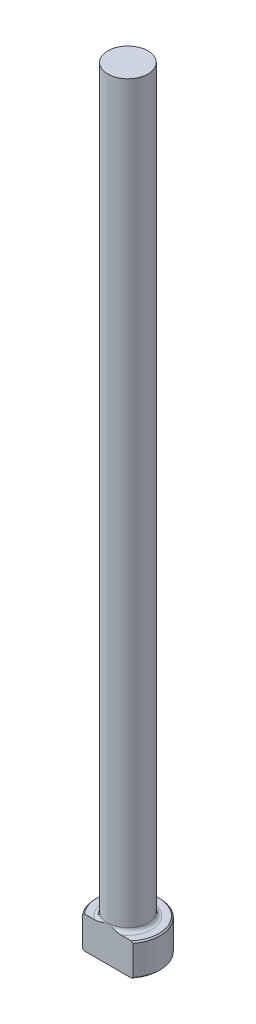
from build123d import *

# Parameters (mm, degrees)
CHAMFER1_SIZE = 0.254
FILLET1_R     = 0.762
KEY_DEPTH     = 153.664354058


with BuildPart() as part:
    # Sketch1 → Revolve1 (revolve)
    with BuildSketch(Plane.XY, mode=Mode.PRIVATE) as revolve1_sk:
        Polygon((0, 0), (-6.35, 0), (-6.35, 6.35), (-3.96875, 6.35), (-3.96875, 152.4), (0, 152.4), align=None)
    revolve(revolve1_sk.sketch.rotate(Axis((0, 259.958771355, 0), (0, -1, 0)), 270), axis=Axis((0, 259.958771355, 0), (0, -1, 0)))

    # Chamfer1
    chamfer1_edges = [part.edges().sort_by_distance(p)[0] for p in [
        (0, 6.35, -6.35),
        (0, 0, -6.35),
    ]]
    chamfer(chamfer1_edges, length=CHAMFER1_SIZE)

    # Fillet1
    fillet1_edges = [part.edges().sort_by_distance(p)[0] for p in [
        (0, 6.35, -3.96875),
    ]]
    fillet(fillet1_edges, radius=FILLET1_R)

    # Sketch2 → Key (cut, through all)
    with BuildSketch(Plane(origin=(0, 0, 0), x_dir=(1, 0, 0), z_dir=(0, 1, 0))):
        with BuildLine():
            Line((-4.956967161, -3.96875), (4.956967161, -3.96875))
            ThreePointArc((4.956967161, -3.96875), (0, -6.35), (-4.956967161, -3.96875))
        make_face()
    extrude(amount=KEY_DEPTH, mode=Mode.SUBTRACT)


solid = part.part
